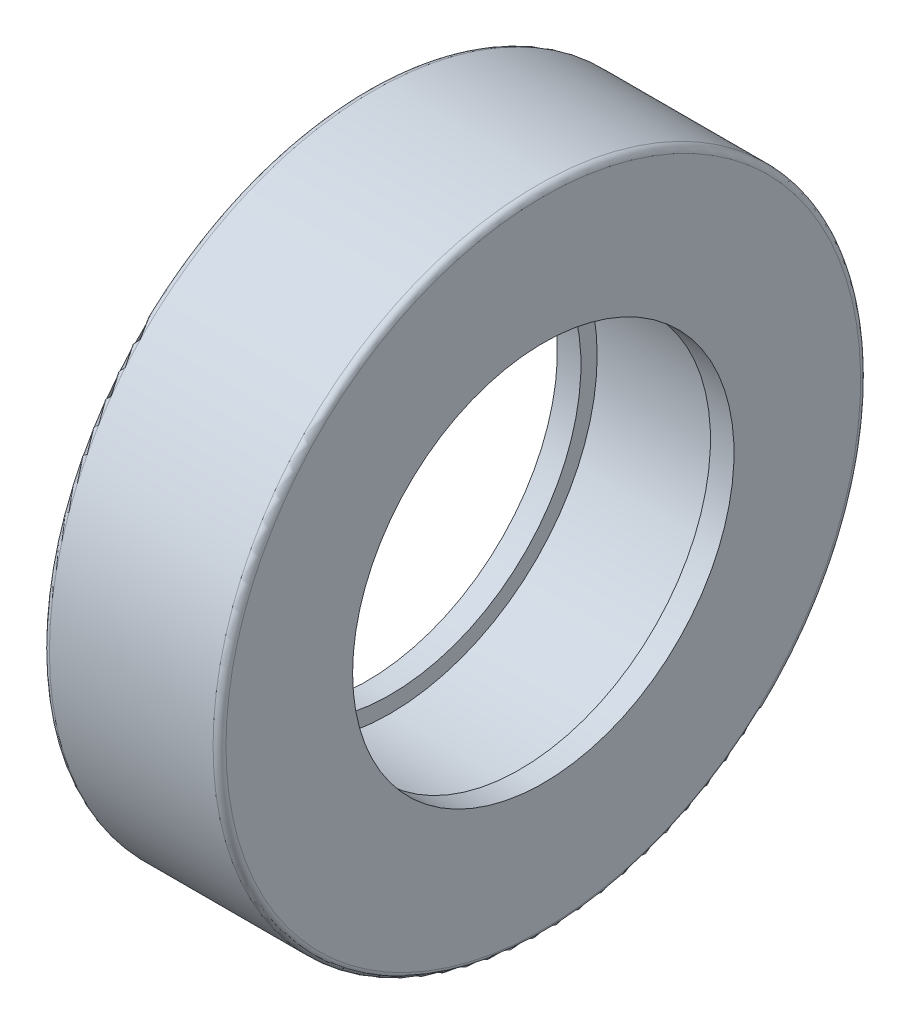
ISO-10303-21;
HEADER;
FILE_DESCRIPTION(('STEP AP214'),'2;1');
FILE_NAME('part.step','',(''),(''),'','','');
FILE_SCHEMA(('AUTOMOTIVE_DESIGN { 1 0 10303 214 1 1 1 1 }'));
ENDSEC;
DATA;
#1=APPLICATION_CONTEXT('core data for automotive mechanical design processes');
#2=APPLICATION_PROTOCOL_DEFINITION('international standard','automotive_design',2000,#1);
#3=PRODUCT_CONTEXT('',#1,'mechanical');
#4=PRODUCT('Part','Part','',(#3));
#5=PRODUCT_RELATED_PRODUCT_CATEGORY('part','',(#4));
#6=PRODUCT_DEFINITION_FORMATION('','',#4);
#7=PRODUCT_DEFINITION_CONTEXT('part definition',#1,'design');
#8=PRODUCT_DEFINITION('design','',#6,#7);
#9=PRODUCT_DEFINITION_SHAPE('','',#8);
#10=(LENGTH_UNIT() NAMED_UNIT(*) SI_UNIT(.MILLI.,.METRE.));
#11=(NAMED_UNIT(*) PLANE_ANGLE_UNIT() SI_UNIT($,.RADIAN.));
#12=(NAMED_UNIT(*) SI_UNIT($,.STERADIAN.) SOLID_ANGLE_UNIT());
#13=UNCERTAINTY_MEASURE_WITH_UNIT(LENGTH_MEASURE(1.E-05),#10,'distance_accuracy_value','');
#14=(GEOMETRIC_REPRESENTATION_CONTEXT(3) GLOBAL_UNCERTAINTY_ASSIGNED_CONTEXT((#13)) GLOBAL_UNIT_ASSIGNED_CONTEXT((#10,
#11,#12)) REPRESENTATION_CONTEXT('',''));
#15=CARTESIAN_POINT('',(0.,0.,0.));
#16=DIRECTION('',(0.,0.,1.));
#17=DIRECTION('',(1.,0.,0.));
#18=AXIS2_PLACEMENT_3D('',#15,#16,#17);
#19=CARTESIAN_POINT('',(5.,0.,0.));
#20=DIRECTION('',(-1.,0.,0.));
#21=DIRECTION('',(0.,0.,1.));
#22=AXIS2_PLACEMENT_3D('',#19,#20,#21);
#23=CYLINDRICAL_SURFACE('',#22,32.395);
#24=CARTESIAN_POINT('',(5.,0.,0.));
#25=DIRECTION('',(-1.,0.,0.));
#26=DIRECTION('',(0.,0.,1.));
#27=AXIS2_PLACEMENT_3D('',#24,#25,#26);
#28=CIRCLE('',#27,32.395);
#29=CARTESIAN_POINT('',(5.,0.,32.395));
#30=VERTEX_POINT('',#29);
#31=EDGE_CURVE('E45',#30,#30,#28,.T.);
#32=ORIENTED_EDGE('',*,*,#31,.F.);
#33=EDGE_LOOP('',(#32));
#34=FACE_BOUND('',#33,.T.);
#35=CARTESIAN_POINT('',(1.,0.,0.));
#36=DIRECTION('',(-1.,0.,0.));
#37=DIRECTION('',(0.,0.,1.));
#38=AXIS2_PLACEMENT_3D('',#35,#36,#37);
#39=CIRCLE('',#38,32.395);
#40=CARTESIAN_POINT('',(1.,0.,32.395));
#41=VERTEX_POINT('',#40);
#42=EDGE_CURVE('E19',#41,#41,#39,.F.);
#43=ORIENTED_EDGE('',*,*,#42,.F.);
#44=EDGE_LOOP('',(#43));
#45=FACE_BOUND('',#44,.T.);
#46=ADVANCED_FACE('F14',(#34,#45),#23,.F.);
#47=CARTESIAN_POINT('',(1.,43.1475,0.));
#48=DIRECTION('',(-1.,0.,0.));
#49=DIRECTION('',(0.,0.,1.));
#50=AXIS2_PLACEMENT_3D('',#47,#48,#49);
#51=PLANE('',#50);
#52=CARTESIAN_POINT('',(1.,0.,0.));
#53=DIRECTION('',(1.,0.,0.));
#54=DIRECTION('',(0.,1.,0.));
#55=AXIS2_PLACEMENT_3D('',#52,#53,#54);
#56=CIRCLE('',#55,53.9);
#57=CARTESIAN_POINT('',(1.,53.9,0.));
#58=VERTEX_POINT('',#57);
#59=EDGE_CURVE('E44',#58,#58,#56,.T.);
#60=ORIENTED_EDGE('',*,*,#59,.F.);
#61=EDGE_LOOP('',(#60));
#62=FACE_BOUND('',#61,.T.);
#63=ORIENTED_EDGE('',*,*,#42,.T.);
#64=EDGE_LOOP('',(#63));
#65=FACE_BOUND('',#64,.T.);
#66=ADVANCED_FACE('F53',(#62,#65),#51,.T.);
#67=CARTESIAN_POINT('',(5.,33.7725,0.));
#68=DIRECTION('',(1.,0.,0.));
#69=DIRECTION('',(0.,0.,-1.));
#70=AXIS2_PLACEMENT_3D('',#67,#68,#69);
#71=PLANE('',#70);
#72=ORIENTED_EDGE('',*,*,#31,.T.);
#73=EDGE_LOOP('',(#72));
#74=FACE_BOUND('',#73,.T.);
#75=CARTESIAN_POINT('',(5.,0.,0.));
#76=DIRECTION('',(-1.,0.,0.));
#77=DIRECTION('',(0.,0.,1.));
#78=AXIS2_PLACEMENT_3D('',#75,#76,#77);
#79=CIRCLE('',#78,35.15);
#80=CARTESIAN_POINT('',(5.,0.,35.15));
#81=VERTEX_POINT('',#80);
#82=EDGE_CURVE('E42',#81,#81,#79,.T.);
#83=ORIENTED_EDGE('',*,*,#82,.F.);
#84=EDGE_LOOP('',(#83));
#85=FACE_BOUND('',#84,.T.);
#86=ADVANCED_FACE('F62',(#74,#85),#71,.T.);
#87=CARTESIAN_POINT('',(2.10000000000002,0.,0.));
#88=DIRECTION('',(-1.,0.,0.));
#89=DIRECTION('',(0.,0.,1.));
#90=AXIS2_PLACEMENT_3D('',#87,#88,#89);
#91=TOROIDAL_SURFACE('',#90,53.9,1.10000000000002);
#92=CARTESIAN_POINT('',(2.1,0.,0.));
#93=DIRECTION('',(-1.,0.,0.));
#94=DIRECTION('',(0.,0.,1.));
#95=AXIS2_PLACEMENT_3D('',#92,#93,#94);
#96=CIRCLE('',#95,55.);
#97=CARTESIAN_POINT('',(2.1,0.,55.));
#98=VERTEX_POINT('',#97);
#99=EDGE_CURVE('E41',#98,#98,#96,.F.);
#100=ORIENTED_EDGE('',*,*,#99,.F.);
#101=EDGE_LOOP('',(#100));
#102=FACE_BOUND('',#101,.T.);
#103=ORIENTED_EDGE('',*,*,#59,.T.);
#104=EDGE_LOOP('',(#103));
#105=FACE_BOUND('',#104,.T.);
#106=ADVANCED_FACE('F110',(#102,#105),#91,.T.);
#107=CARTESIAN_POINT('',(27.,0.,0.));
#108=DIRECTION('',(-1.,0.,0.));
#109=DIRECTION('',(0.,0.,1.));
#110=AXIS2_PLACEMENT_3D('',#107,#108,#109);
#111=CYLINDRICAL_SURFACE('',#110,35.15);
#112=CARTESIAN_POINT('',(27.,0.,0.));
#113=DIRECTION('',(-1.,0.,0.));
#114=DIRECTION('',(0.,0.,1.));
#115=AXIS2_PLACEMENT_3D('',#112,#113,#114);
#116=CIRCLE('',#115,35.15);
#117=CARTESIAN_POINT('',(27.,0.,35.15));
#118=VERTEX_POINT('',#117);
#119=EDGE_CURVE('E38',#118,#118,#116,.T.);
#120=ORIENTED_EDGE('',*,*,#119,.F.);
#121=EDGE_LOOP('',(#120));
#122=FACE_BOUND('',#121,.T.);
#123=ORIENTED_EDGE('',*,*,#82,.T.);
#124=EDGE_LOOP('',(#123));
#125=FACE_BOUND('',#124,.T.);
#126=ADVANCED_FACE('F115',(#122,#125),#111,.F.);
#127=CARTESIAN_POINT('',(16.,0.,0.));
#128=DIRECTION('',(-1.,0.,0.));
#129=DIRECTION('',(0.,0.,1.));
#130=AXIS2_PLACEMENT_3D('',#127,#128,#129);
#131=CYLINDRICAL_SURFACE('',#130,55.);
#132=ORIENTED_EDGE('',*,*,#99,.T.);
#133=EDGE_LOOP('',(#132));
#134=FACE_BOUND('',#133,.T.);
#135=CARTESIAN_POINT('',(29.9,0.,0.));
#136=DIRECTION('',(-1.,0.,0.));
#137=DIRECTION('',(0.,0.,1.));
#138=AXIS2_PLACEMENT_3D('',#135,#136,#137);
#139=CIRCLE('',#138,55.);
#140=CARTESIAN_POINT('',(29.9,0.,55.));
#141=VERTEX_POINT('',#140);
#142=EDGE_CURVE('E37',#141,#141,#139,.F.);
#143=ORIENTED_EDGE('',*,*,#142,.F.);
#144=EDGE_LOOP('',(#143));
#145=FACE_BOUND('',#144,.T.);
#146=ADVANCED_FACE('F118',(#134,#145),#131,.T.);
#147=CARTESIAN_POINT('',(27.,33.7725,0.));
#148=DIRECTION('',(-1.,0.,0.));
#149=DIRECTION('',(0.,0.,1.));
#150=AXIS2_PLACEMENT_3D('',#147,#148,#149);
#151=PLANE('',#150);
#152=ORIENTED_EDGE('',*,*,#119,.T.);
#153=EDGE_LOOP('',(#152));
#154=FACE_BOUND('',#153,.T.);
#155=CARTESIAN_POINT('',(27.,0.,0.));
#156=DIRECTION('',(-1.,0.,0.));
#157=DIRECTION('',(0.,0.,1.));
#158=AXIS2_PLACEMENT_3D('',#155,#156,#157);
#159=CIRCLE('',#158,32.395);
#160=CARTESIAN_POINT('',(27.,0.,32.395));
#161=VERTEX_POINT('',#160);
#162=EDGE_CURVE('E28',#161,#161,#159,.T.);
#163=ORIENTED_EDGE('',*,*,#162,.F.);
#164=EDGE_LOOP('',(#163));
#165=FACE_BOUND('',#164,.T.);
#166=ADVANCED_FACE('F99',(#154,#165),#151,.T.);
#167=CARTESIAN_POINT('',(29.9,0.,0.));
#168=DIRECTION('',(-1.,0.,0.));
#169=DIRECTION('',(0.,0.,1.));
#170=AXIS2_PLACEMENT_3D('',#167,#168,#169);
#171=TOROIDAL_SURFACE('',#170,53.9,1.10000000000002);
#172=CARTESIAN_POINT('',(31.,0.,0.));
#173=DIRECTION('',(-1.,0.,0.));
#174=DIRECTION('',(0.,1.,0.));
#175=AXIS2_PLACEMENT_3D('',#172,#173,#174);
#176=CIRCLE('',#175,53.9);
#177=CARTESIAN_POINT('',(31.,53.9,0.));
#178=VERTEX_POINT('',#177);
#179=EDGE_CURVE('E23',#178,#178,#176,.F.);
#180=ORIENTED_EDGE('',*,*,#179,.F.);
#181=EDGE_LOOP('',(#180));
#182=FACE_BOUND('',#181,.T.);
#183=ORIENTED_EDGE('',*,*,#142,.T.);
#184=EDGE_LOOP('',(#183));
#185=FACE_BOUND('',#184,.T.);
#186=ADVANCED_FACE('F70',(#182,#185),#171,.T.);
#187=CARTESIAN_POINT('',(31.,0.,0.));
#188=DIRECTION('',(-1.,0.,0.));
#189=DIRECTION('',(0.,0.,1.));
#190=AXIS2_PLACEMENT_3D('',#187,#188,#189);
#191=CYLINDRICAL_SURFACE('',#190,32.395);
#192=CARTESIAN_POINT('',(31.,0.,0.));
#193=DIRECTION('',(-1.,0.,0.));
#194=DIRECTION('',(0.,0.,1.));
#195=AXIS2_PLACEMENT_3D('',#192,#193,#194);
#196=CIRCLE('',#195,32.395);
#197=CARTESIAN_POINT('',(31.,0.,32.395));
#198=VERTEX_POINT('',#197);
#199=EDGE_CURVE('E10',#198,#198,#196,.T.);
#200=ORIENTED_EDGE('',*,*,#199,.F.);
#201=EDGE_LOOP('',(#200));
#202=FACE_BOUND('',#201,.T.);
#203=ORIENTED_EDGE('',*,*,#162,.T.);
#204=EDGE_LOOP('',(#203));
#205=FACE_BOUND('',#204,.T.);
#206=ADVANCED_FACE('F66',(#202,#205),#191,.F.);
#207=CARTESIAN_POINT('',(31.,43.1475,0.));
#208=DIRECTION('',(1.,0.,0.));
#209=DIRECTION('',(0.,0.,-1.));
#210=AXIS2_PLACEMENT_3D('',#207,#208,#209);
#211=PLANE('',#210);
#212=ORIENTED_EDGE('',*,*,#199,.T.);
#213=EDGE_LOOP('',(#212));
#214=FACE_BOUND('',#213,.T.);
#215=ORIENTED_EDGE('',*,*,#179,.T.);
#216=EDGE_LOOP('',(#215));
#217=FACE_BOUND('',#216,.T.);
#218=ADVANCED_FACE('F16',(#214,#217),#211,.T.);
#219=CLOSED_SHELL('',(#46,#66,#86,#106,#126,#146,#166,#186,#206,#218));
#220=MANIFOLD_SOLID_BREP('B1',#219);
#221=ADVANCED_BREP_SHAPE_REPRESENTATION('',(#18,#220),#14);
#222=SHAPE_DEFINITION_REPRESENTATION(#9,#221);
ENDSEC;
END-ISO-10303-21;
